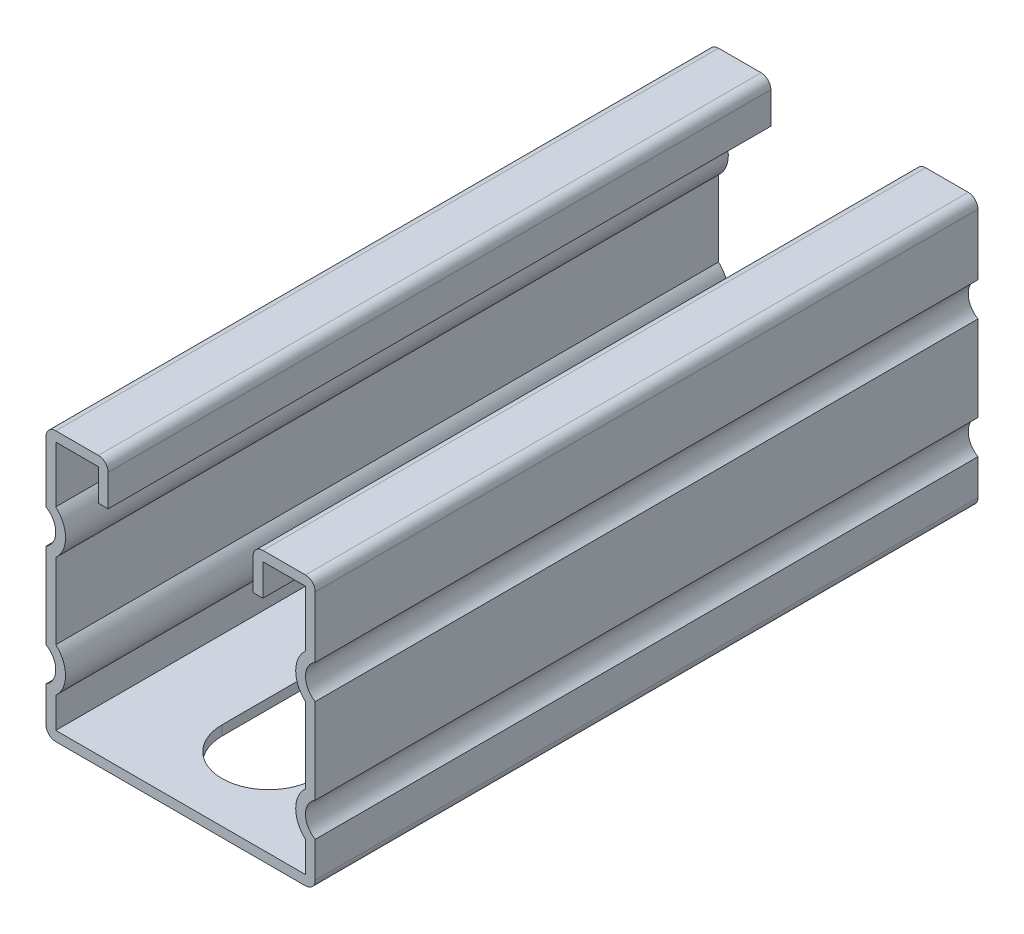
from build123d import *

# Parameters (mm, degrees)
BASE_EXTRUDE_DEPTH = 101.6
SLOT_DEPTH         = 130.106385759
LPATTERN1_COUNT    = 2
LPATTERN1_PITCH    = 50.8


with BuildPart() as part:
    # Sketch1 → Base-Extrude (new body)
    with BuildSketch(Plane.XY):
        with BuildLine():
            Line((-20.6375, 21.1074), (-20.6375, 11.73965134))
            ThreePointArc((-20.6375, 11.73965134), (-19.1389, 9.144), (-20.6375, 6.54834866))
            Line((-20.6375, 6.54834866), (-20.6375, -6.54834866))
            ThreePointArc((-20.6375, -6.54834866), (-19.1389, -9.144), (-20.6375, -11.73965134))
            Line((-20.6375, -11.73965134), (-20.6375, -17.1704))
            ThreePointArc((-20.6375, -17.1704), (-20.198570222, -18.230070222), (-19.1389, -18.669))
            Line((-19.1389, -18.669), (19.1389, -18.669))
            ThreePointArc((19.1389, -18.669), (20.198570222, -18.230070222), (20.6375, -17.1704))
            Line((20.6375, -17.1704), (20.6375, -11.73965134))
            ThreePointArc((20.6375, -11.73965134), (19.1389, -9.144), (20.6375, -6.54834866))
            Line((20.6375, -6.54834866), (20.6375, 6.54834866))
            ThreePointArc((20.6375, 6.54834866), (19.1389, 9.144), (20.6375, 11.73965134))
            Line((20.6375, 11.73965134), (20.6375, 21.1074))
            ThreePointArc((20.6375, 21.1074), (20.198570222, 22.167070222), (19.1389, 22.606))
            Line((19.1389, 22.606), (12.6111, 22.606))
            ThreePointArc((12.6111, 22.606), (11.551429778, 22.167070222), (11.1125, 21.1074))
            Line((11.1125, 21.1074), (11.1125, 16.256))
            Line((11.1125, 16.256), (12.6111, 16.256))
            Line((12.6111, 16.256), (12.6111, 21.1074))
            Line((12.6111, 21.1074), (19.1389, 21.1074))
            Line((19.1389, 21.1074), (19.1389, 12.494971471))
            ThreePointArc((19.1389, 12.494971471), (17.6403, 9.144), (19.1389, 5.793028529))
            Line((19.1389, 5.793028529), (19.1389, -5.793028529))
            ThreePointArc((19.1389, -5.793028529), (17.6403, -9.144), (19.1389, -12.494971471))
            Line((19.1389, -12.494971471), (19.1389, -17.1704))
            Line((19.1389, -17.1704), (-19.1389, -17.1704))
            Line((-19.1389, -17.1704), (-19.1389, -12.494971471))
            ThreePointArc((-19.1389, -12.494971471), (-17.6403, -9.144), (-19.1389, -5.793028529))
            Line((-19.1389, -5.793028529), (-19.1389, 5.793028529))
            ThreePointArc((-19.1389, 5.793028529), (-17.6403, 9.144), (-19.1389, 12.494971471))
            Line((-19.1389, 12.494971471), (-19.1389, 21.1074))
            Line((-19.1389, 21.1074), (-12.6111, 21.1074))
            Line((-12.6111, 21.1074), (-12.6111, 16.256))
            Line((-12.6111, 16.256), (-11.1125, 16.256))
            Line((-11.1125, 16.256), (-11.1125, 21.1074))
            ThreePointArc((-11.1125, 21.1074), (-11.551429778, 22.167070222), (-12.6111, 22.606))
            Line((-12.6111, 22.606), (-19.1389, 22.606))
            ThreePointArc((-19.1389, 22.606), (-20.198570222, 22.167070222), (-20.6375, 21.1074))
        make_face()
    extrude(amount=BASE_EXTRUDE_DEPTH)

    # Sketch2 → Slot (cut, through all)
    with BuildSketch(Plane(origin=(1.121412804, -18.669, -18.780160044), x_dir=(1, 0, 0), z_dir=(0, -1, 0))):
        with BuildLine():
            Line((6.022337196, 56.086410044), (6.022337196, 41.798910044))
            ThreePointArc((6.022337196, 41.798910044), (-1.121412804, 34.655160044), (-8.265162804, 41.798910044))
            Line((-8.265162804, 41.798910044), (-8.265162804, 56.086410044))
            ThreePointArc((-8.265162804, 56.086410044), (-1.121412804, 63.230160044), (6.022337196, 56.086410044))
        make_face()
    slot = extrude(amount=-SLOT_DEPTH, mode=Mode.SUBTRACT)

    # LPattern1: Slot ×2
    with Locations(*[(0, 0, i * LPATTERN1_PITCH) for i in range(1, LPATTERN1_COUNT)]):
        add(slot, mode=Mode.SUBTRACT)


solid = part.part
